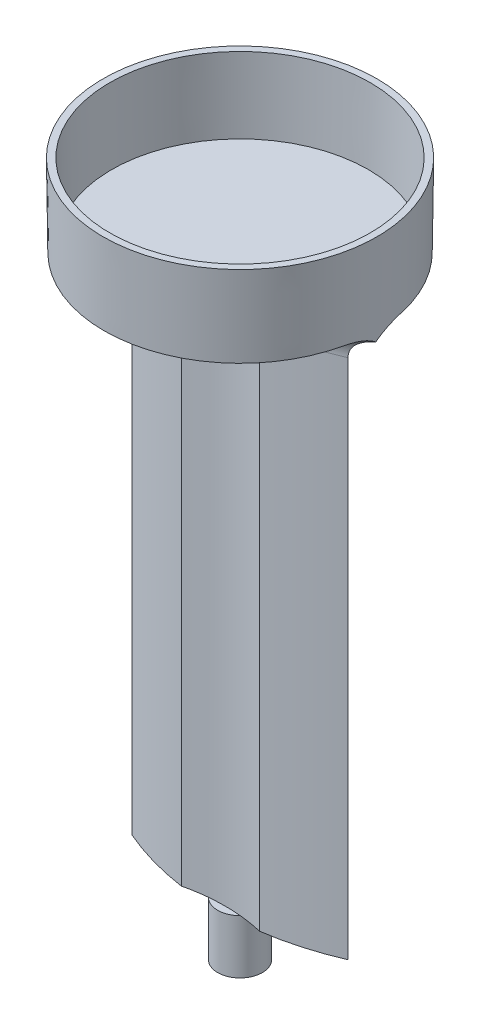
ISO-10303-21;
HEADER;
FILE_DESCRIPTION(('STEP AP214'),'2;1');
FILE_NAME('part.step','',(''),(''),'','','');
FILE_SCHEMA(('AUTOMOTIVE_DESIGN { 1 0 10303 214 1 1 1 1 }'));
ENDSEC;
DATA;
#1=APPLICATION_CONTEXT('core data for automotive mechanical design processes');
#2=APPLICATION_PROTOCOL_DEFINITION('international standard','automotive_design',2000,#1);
#3=PRODUCT_CONTEXT('',#1,'mechanical');
#4=PRODUCT('Part','Part','',(#3));
#5=PRODUCT_RELATED_PRODUCT_CATEGORY('part','',(#4));
#6=PRODUCT_DEFINITION_FORMATION('','',#4);
#7=PRODUCT_DEFINITION_CONTEXT('part definition',#1,'design');
#8=PRODUCT_DEFINITION('design','',#6,#7);
#9=PRODUCT_DEFINITION_SHAPE('','',#8);
#10=(LENGTH_UNIT() NAMED_UNIT(*) SI_UNIT(.MILLI.,.METRE.));
#11=(NAMED_UNIT(*) PLANE_ANGLE_UNIT() SI_UNIT($,.RADIAN.));
#12=(NAMED_UNIT(*) SI_UNIT($,.STERADIAN.) SOLID_ANGLE_UNIT());
#13=UNCERTAINTY_MEASURE_WITH_UNIT(LENGTH_MEASURE(1.E-05),#10,'distance_accuracy_value','');
#14=(GEOMETRIC_REPRESENTATION_CONTEXT(3) GLOBAL_UNCERTAINTY_ASSIGNED_CONTEXT((#13)) GLOBAL_UNIT_ASSIGNED_CONTEXT((#10,
#11,#12)) REPRESENTATION_CONTEXT('',''));
#15=CARTESIAN_POINT('',(0.,0.,0.));
#16=DIRECTION('',(0.,0.,1.));
#17=DIRECTION('',(1.,0.,0.));
#18=AXIS2_PLACEMENT_3D('',#15,#16,#17);
#19=CARTESIAN_POINT('',(0.,-152.,0.));
#20=DIRECTION('',(0.,1.,0.));
#21=DIRECTION('',(0.,0.,1.));
#22=AXIS2_PLACEMENT_3D('',#19,#20,#21);
#23=PLANE('',#22);
#24=CARTESIAN_POINT('',(0.,-152.,0.));
#25=DIRECTION('',(0.,-1.,0.));
#26=DIRECTION('',(0.,0.,-1.));
#27=AXIS2_PLACEMENT_3D('',#24,#25,#26);
#28=CIRCLE('',#27,6.);
#29=CARTESIAN_POINT('',(4.27486119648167,-152.,-4.21017360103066));
#30=VERTEX_POINT('',#29);
#31=CARTESIAN_POINT('',(4.27486119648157,-152.,4.21017360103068));
#32=VERTEX_POINT('',#31);
#33=EDGE_CURVE('E49',#30,#32,#28,.T.);
#34=ORIENTED_EDGE('',*,*,#33,.F.);
#35=CARTESIAN_POINT('',(0.,-152.,-49.0475830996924));
#36=DIRECTION('',(0.,-1.,0.));
#37=DIRECTION('',(0.,0.,1.));
#38=AXIS2_PLACEMENT_3D('',#35,#36,#37);
#39=CIRCLE('',#38,45.0407341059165);
#40=CARTESIAN_POINT('',(10.5,-152.,-5.24783733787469));
#41=VERTEX_POINT('',#40);
#42=EDGE_CURVE('E141',#41,#30,#39,.T.);
#43=ORIENTED_EDGE('',*,*,#42,.F.);
#44=CARTESIAN_POINT('',(0.,-152.,67.));
#45=DIRECTION('',(0.,-1.,0.));
#46=DIRECTION('',(0.,0.,-1.));
#47=AXIS2_PLACEMENT_3D('',#44,#45,#46);
#48=CIRCLE('',#47,73.0068489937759);
#49=CARTESIAN_POINT('',(29.,-152.,0.));
#50=VERTEX_POINT('',#49);
#51=EDGE_CURVE('E179',#41,#50,#48,.T.);
#52=ORIENTED_EDGE('',*,*,#51,.T.);
#53=CARTESIAN_POINT('',(0.,-152.,-67.));
#54=DIRECTION('',(0.,-1.,0.));
#55=DIRECTION('',(0.,0.,1.));
#56=AXIS2_PLACEMENT_3D('',#53,#54,#55);
#57=CIRCLE('',#56,73.0068489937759);
#58=CARTESIAN_POINT('',(10.5,-152.,5.24783733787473));
#59=VERTEX_POINT('',#58);
#60=EDGE_CURVE('E177',#50,#59,#57,.T.);
#61=ORIENTED_EDGE('',*,*,#60,.T.);
#62=CARTESIAN_POINT('',(0.,-152.,49.0475830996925));
#63=DIRECTION('',(0.,-1.,0.));
#64=DIRECTION('',(0.,0.,-1.));
#65=AXIS2_PLACEMENT_3D('',#62,#63,#64);
#66=CIRCLE('',#65,45.0407341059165);
#67=EDGE_CURVE('E61',#32,#59,#66,.T.);
#68=ORIENTED_EDGE('',*,*,#67,.F.);
#69=EDGE_LOOP('',(#34,#43,#52,#61,#68));
#70=FACE_BOUND('',#69,.T.);
#71=ADVANCED_FACE('F33',(#70),#23,.F.);
#72=CARTESIAN_POINT('',(-36.5,-2.,0.));
#73=DIRECTION('',(0.,1.,0.));
#74=DIRECTION('',(0.,0.,1.));
#75=AXIS2_PLACEMENT_3D('',#72,#73,#74);
#76=PLANE('',#75);
#77=CARTESIAN_POINT('',(0.,-2.,0.));
#78=DIRECTION('',(0.,-1.,0.));
#79=DIRECTION('',(0.,0.,-1.));
#80=AXIS2_PLACEMENT_3D('',#77,#78,#79);
#81=CIRCLE('',#80,36.5);
#82=CARTESIAN_POINT('',(35.6177085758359,-2.,7.97676850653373));
#83=VERTEX_POINT('',#82);
#84=CARTESIAN_POINT('',(-35.6177085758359,-2.,7.97676850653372));
#85=VERTEX_POINT('',#84);
#86=EDGE_CURVE('E190',#83,#85,#81,.T.);
#87=ORIENTED_EDGE('',*,*,#86,.T.);
#88=CARTESIAN_POINT('',(0.,-2.,-67.));
#89=DIRECTION('',(0.,1.,0.));
#90=DIRECTION('',(0.,0.,1.));
#91=AXIS2_PLACEMENT_3D('',#88,#89,#90);
#92=CIRCLE('',#91,83.0068489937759);
#93=CARTESIAN_POINT('',(-9.8514383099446,-2.,15.4201804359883));
#94=VERTEX_POINT('',#93);
#95=EDGE_CURVE('E213',#85,#94,#92,.T.);
#96=ORIENTED_EDGE('',*,*,#95,.T.);
#97=CARTESIAN_POINT('',(0.,-2.,49.0475830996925));
#98=DIRECTION('',(0.,1.,0.));
#99=DIRECTION('',(0.,0.,1.));
#100=AXIS2_PLACEMENT_3D('',#97,#98,#99);
#101=CIRCLE('',#100,35.0407341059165);
#102=CARTESIAN_POINT('',(9.85143830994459,-2.,15.4201804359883));
#103=VERTEX_POINT('',#102);
#104=EDGE_CURVE('E211',#94,#103,#101,.F.);
#105=ORIENTED_EDGE('',*,*,#104,.T.);
#106=CARTESIAN_POINT('',(0.,-2.,-67.));
#107=DIRECTION('',(0.,1.,0.));
#108=DIRECTION('',(0.,0.,1.));
#109=AXIS2_PLACEMENT_3D('',#106,#107,#108);
#110=CIRCLE('',#109,83.0068489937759);
#111=EDGE_CURVE('E209',#103,#83,#110,.T.);
#112=ORIENTED_EDGE('',*,*,#111,.T.);
#113=EDGE_LOOP('',(#87,#96,#105,#112));
#114=FACE_BOUND('',#113,.T.);
#115=ADVANCED_FACE('F312',(#114),#76,.F.);
#116=CARTESIAN_POINT('',(0.,-152.,-67.));
#117=DIRECTION('',(0.,1.,0.));
#118=DIRECTION('',(0.,0.,1.));
#119=AXIS2_PLACEMENT_3D('',#116,#117,#118);
#120=CYLINDRICAL_SURFACE('',#119,73.0068489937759);
#121=DIRECTION('',(0.,1.,0.));
#122=VECTOR('',#121,1.);
#123=CARTESIAN_POINT('',(29.,-152.,0.));
#124=LINE('',#123,#122);
#125=CARTESIAN_POINT('',(29.,-12.,0.));
#126=VERTEX_POINT('',#125);
#127=EDGE_CURVE('E181',#50,#126,#124,.T.);
#128=ORIENTED_EDGE('',*,*,#127,.T.);
#129=CARTESIAN_POINT('',(0.,-12.,-67.));
#130=DIRECTION('',(0.,1.,0.));
#131=DIRECTION('',(0.,0.,1.));
#132=AXIS2_PLACEMENT_3D('',#129,#130,#131);
#133=CIRCLE('',#132,73.0068489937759);
#134=CARTESIAN_POINT('',(10.5,-12.,5.24783733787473));
#135=VERTEX_POINT('',#134);
#136=EDGE_CURVE('E218',#126,#135,#133,.F.);
#137=ORIENTED_EDGE('',*,*,#136,.T.);
#138=DIRECTION('',(0.,-1.,0.));
#139=VECTOR('',#138,1.);
#140=CARTESIAN_POINT('',(10.5,-2.,5.24783733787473));
#141=LINE('',#140,#139);
#142=EDGE_CURVE('E168',#135,#59,#141,.T.);
#143=ORIENTED_EDGE('',*,*,#142,.T.);
#144=ORIENTED_EDGE('',*,*,#60,.F.);
#145=EDGE_LOOP('',(#128,#137,#143,#144));
#146=FACE_BOUND('',#145,.T.);
#147=ADVANCED_FACE('F317',(#146),#120,.T.);
#148=CARTESIAN_POINT('',(0.,-152.,67.));
#149=DIRECTION('',(0.,1.,0.));
#150=DIRECTION('',(0.,0.,1.));
#151=AXIS2_PLACEMENT_3D('',#148,#149,#150);
#152=CYLINDRICAL_SURFACE('',#151,73.0068489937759);
#153=DIRECTION('',(0.,1.,0.));
#154=VECTOR('',#153,1.);
#155=CARTESIAN_POINT('',(-29.,-152.,0.));
#156=LINE('',#155,#154);
#157=CARTESIAN_POINT('',(-29.,-152.,0.));
#158=VERTEX_POINT('',#157);
#159=CARTESIAN_POINT('',(-29.,-12.,0.));
#160=VERTEX_POINT('',#159);
#161=EDGE_CURVE('E184',#158,#160,#156,.T.);
#162=ORIENTED_EDGE('',*,*,#161,.T.);
#163=CARTESIAN_POINT('',(0.,-12.,67.));
#164=DIRECTION('',(0.,1.,0.));
#165=DIRECTION('',(0.,0.,1.));
#166=AXIS2_PLACEMENT_3D('',#163,#164,#165);
#167=CIRCLE('',#166,73.0068489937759);
#168=CARTESIAN_POINT('',(-10.5,-12.,-5.24783733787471));
#169=VERTEX_POINT('',#168);
#170=EDGE_CURVE('E222',#160,#169,#167,.F.);
#171=ORIENTED_EDGE('',*,*,#170,.T.);
#172=DIRECTION('',(0.,-1.,0.));
#173=VECTOR('',#172,1.);
#174=CARTESIAN_POINT('',(-10.5,-2.,-5.24783733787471));
#175=LINE('',#174,#173);
#176=CARTESIAN_POINT('',(-10.5,-152.,-5.24783733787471));
#177=VERTEX_POINT('',#176);
#178=EDGE_CURVE('E174',#169,#177,#175,.T.);
#179=ORIENTED_EDGE('',*,*,#178,.T.);
#180=EDGE_CURVE('E152',#158,#177,#48,.T.);
#181=ORIENTED_EDGE('',*,*,#180,.F.);
#182=EDGE_LOOP('',(#162,#171,#179,#181));
#183=FACE_BOUND('',#182,.T.);
#184=ADVANCED_FACE('F330',(#183),#152,.T.);
#185=CARTESIAN_POINT('',(-34.49,0.,0.));
#186=DIRECTION('',(0.,-1.,0.));
#187=DIRECTION('',(0.,0.,-1.));
#188=AXIS2_PLACEMENT_3D('',#185,#186,#187);
#189=PLANE('',#188);
#190=CARTESIAN_POINT('',(0.,0.,0.));
#191=DIRECTION('',(0.,-1.,0.));
#192=DIRECTION('',(0.,0.,-1.));
#193=AXIS2_PLACEMENT_3D('',#190,#191,#192);
#194=CIRCLE('',#193,34.49);
#195=CARTESIAN_POINT('',(0.,0.,-34.49));
#196=VERTEX_POINT('',#195);
#197=EDGE_CURVE('E197',#196,#196,#194,.T.);
#198=ORIENTED_EDGE('',*,*,#197,.F.);
#199=EDGE_LOOP('',(#198));
#200=FACE_BOUND('',#199,.T.);
#201=ADVANCED_FACE('F252',(#200),#189,.F.);
#202=CARTESIAN_POINT('',(0.,0.,0.));
#203=DIRECTION('',(0.,1.,0.));
#204=DIRECTION('',(0.,0.,1.));
#205=AXIS2_PLACEMENT_3D('',#202,#203,#204);
#206=CONICAL_SURFACE('',#205,34.49,0.0239953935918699);
#207=CARTESIAN_POINT('',(0.,20.,0.));
#208=DIRECTION('',(0.,-1.,0.));
#209=DIRECTION('',(0.,0.,-1.));
#210=AXIS2_PLACEMENT_3D('',#207,#208,#209);
#211=CIRCLE('',#210,34.97);
#212=CARTESIAN_POINT('',(0.,20.,-34.97));
#213=VERTEX_POINT('',#212);
#214=EDGE_CURVE('E194',#213,#213,#211,.T.);
#215=ORIENTED_EDGE('',*,*,#214,.F.);
#216=EDGE_LOOP('',(#215));
#217=FACE_BOUND('',#216,.T.);
#218=ORIENTED_EDGE('',*,*,#197,.T.);
#219=EDGE_LOOP('',(#218));
#220=FACE_BOUND('',#219,.T.);
#221=ADVANCED_FACE('F343',(#217,#220),#206,.F.);
#222=CARTESIAN_POINT('',(-34.97,20.,0.));
#223=DIRECTION('',(0.,-1.,0.));
#224=DIRECTION('',(0.,0.,-1.));
#225=AXIS2_PLACEMENT_3D('',#222,#223,#224);
#226=PLANE('',#225);
#227=CARTESIAN_POINT('',(0.,20.,0.));
#228=DIRECTION('',(0.,-1.,0.));
#229=DIRECTION('',(0.,0.,-1.));
#230=AXIS2_PLACEMENT_3D('',#227,#228,#229);
#231=CIRCLE('',#230,36.77);
#232=CARTESIAN_POINT('',(0.,20.,-36.77));
#233=VERTEX_POINT('',#232);
#234=EDGE_CURVE('E191',#233,#233,#231,.T.);
#235=ORIENTED_EDGE('',*,*,#234,.F.);
#236=EDGE_LOOP('',(#235));
#237=FACE_BOUND('',#236,.T.);
#238=ORIENTED_EDGE('',*,*,#214,.T.);
#239=EDGE_LOOP('',(#238));
#240=FACE_BOUND('',#239,.T.);
#241=ADVANCED_FACE('F494',(#237,#240),#226,.F.);
#242=CARTESIAN_POINT('',(0.,20.,0.));
#243=DIRECTION('',(0.,1.,0.));
#244=DIRECTION('',(0.,0.,1.));
#245=AXIS2_PLACEMENT_3D('',#242,#243,#244);
#246=CONICAL_SURFACE('',#245,36.77,0.0122721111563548);
#247=CARTESIAN_POINT('',(35.6177085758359,-2.,7.97676850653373));
#248=CARTESIAN_POINT('',(35.6651768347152,-2.00000463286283,7.76482371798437));
#249=CARTESIAN_POINT('',(35.7106902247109,-2.00439085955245,7.55246683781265));
#250=CARTESIAN_POINT('',(35.7977520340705,-2.02222681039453,7.12728083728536));
#251=CARTESIAN_POINT('',(35.8392996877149,-2.03567828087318,6.91445163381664));
#252=CARTESIAN_POINT('',(35.9580011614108,-2.09013211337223,6.27528013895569));
#253=CARTESIAN_POINT('',(36.0290733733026,-2.14523568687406,5.84888015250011));
#254=CARTESIAN_POINT('',(36.152370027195,-2.29251086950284,5.01643792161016));
#255=CARTESIAN_POINT('',(36.2051956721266,-2.38323209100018,4.61022711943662));
#256=CARTESIAN_POINT('',(36.2957226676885,-2.6034447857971,3.8069601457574));
#257=CARTESIAN_POINT('',(36.3334379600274,-2.73290032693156,3.40989585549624));
#258=CARTESIAN_POINT('',(36.3849240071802,-2.98495377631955,2.75266126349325));
#259=CARTESIAN_POINT('',(36.4024948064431,-3.09693044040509,2.48867143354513));
#260=CARTESIAN_POINT('',(36.4312925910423,-3.34001780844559,1.96932583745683));
#261=CARTESIAN_POINT('',(36.4425210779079,-3.47112397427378,1.71396804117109));
#262=CARTESIAN_POINT('',(36.45936265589,-3.75622928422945,1.2073542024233));
#263=CARTESIAN_POINT('',(36.4648222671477,-3.91073473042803,0.956377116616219));
#264=CARTESIAN_POINT('',(36.4703382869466,-4.23986246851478,0.467643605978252));
#265=CARTESIAN_POINT('',(36.4703904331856,-4.41450052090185,0.229897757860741));
#266=CARTESIAN_POINT('',(36.4681029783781,-4.59901657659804,0.));
#267=B_SPLINE_CURVE_WITH_KNOTS('',3,(#247,#248,#249,#250,#251,#252,#253,#254,#255,#256,#257,
#258,#259,#260,#261,#262,#263,#264,#265,#266),.UNSPECIFIED.,.F.,.F.,(4,2,2,2,2,2,2,2,2,4),(0.,
0.651475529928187,1.3030765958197,2.6081963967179,3.86491786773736,5.12047712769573,
5.98160963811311,6.8425381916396,7.72583548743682,8.60982901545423),.UNSPECIFIED.);
#268=CARTESIAN_POINT('',(36.4681029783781,-4.59901657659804,0.));
#269=VERTEX_POINT('',#268);
#270=EDGE_CURVE('E234',#83,#269,#267,.T.);
#271=ORIENTED_EDGE('',*,*,#270,.T.);
#272=CARTESIAN_POINT('',(36.4681029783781,-4.59901657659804,0.));
#273=CARTESIAN_POINT('',(36.4705817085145,-4.39964865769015,-0.248385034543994));
#274=CARTESIAN_POINT('',(36.4703193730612,-4.21183234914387,-0.505928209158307));
#275=CARTESIAN_POINT('',(36.4634082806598,-3.85974136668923,-1.03626142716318));
#276=CARTESIAN_POINT('',(36.4567648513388,-3.69544718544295,-1.30903857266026));
#277=CARTESIAN_POINT('',(36.4362472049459,-3.39128754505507,-1.86576242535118));
#278=CARTESIAN_POINT('',(36.4224102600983,-3.2513010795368,-2.14964464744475));
#279=CARTESIAN_POINT('',(36.3868773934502,-2.99453007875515,-2.72726728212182));
#280=CARTESIAN_POINT('',(36.365180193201,-2.87774932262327,-3.02100929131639));
#281=CARTESIAN_POINT('',(36.313547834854,-2.66733451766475,-3.61482850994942));
#282=CARTESIAN_POINT('',(36.2836402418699,-2.57362497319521,-3.91488147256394));
#283=CARTESIAN_POINT('',(36.215278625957,-2.40820137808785,-4.52002539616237));
#284=CARTESIAN_POINT('',(36.176824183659,-2.33648840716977,-4.82511660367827));
#285=CARTESIAN_POINT('',(36.0912439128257,-2.21426151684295,-5.43838843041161));
#286=CARTESIAN_POINT('',(36.044115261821,-2.16375451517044,-5.74657002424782));
#287=CARTESIAN_POINT('',(35.9412328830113,-2.08312094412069,-6.36405777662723));
#288=CARTESIAN_POINT('',(35.885481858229,-2.05298800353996,-6.67336355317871));
#289=CARTESIAN_POINT('',(35.7932536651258,-2.02162445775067,-7.14858713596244));
#290=CARTESIAN_POINT('',(35.7597852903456,-2.01347222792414,-7.31467066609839));
#291=CARTESIAN_POINT('',(35.6905059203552,-2.00266622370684,-7.64617719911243));
#292=CARTESIAN_POINT('',(35.654699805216,-2.00000135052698,-7.81160085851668));
#293=CARTESIAN_POINT('',(35.6177085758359,-2.00000000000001,-7.97676850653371));
#294=B_SPLINE_CURVE_WITH_KNOTS('',3,(#272,#273,#274,#275,#276,#277,#278,#279,#280,#281,#282,
#283,#284,#285,#286,#287,#288,#289,#290,#291,#292,#293),.UNSPECIFIED.,.F.,.F.,(4,2,2,2,2,2,2,2,
2,2,4),(0.,0.955023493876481,1.90925032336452,2.85858151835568,3.8080671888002,4.75440329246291,
5.70078584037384,6.64747687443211,7.59387173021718,8.10263342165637,8.61036507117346),.UNSPECIFIED.);
#295=CARTESIAN_POINT('',(35.6177085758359,-2.,-7.97676850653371));
#296=VERTEX_POINT('',#295);
#297=EDGE_CURVE('E373',#269,#296,#294,.T.);
#298=ORIENTED_EDGE('',*,*,#297,.T.);
#299=CARTESIAN_POINT('',(-35.6177085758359,-2.,-7.97676850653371));
#300=VERTEX_POINT('',#299);
#301=EDGE_CURVE('E187',#300,#296,#81,.T.);
#302=ORIENTED_EDGE('',*,*,#301,.F.);
#303=CARTESIAN_POINT('',(-35.6177085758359,-2.,-7.97676850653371));
#304=CARTESIAN_POINT('',(-35.6651768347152,-2.00000463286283,-7.76482371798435));
#305=CARTESIAN_POINT('',(-35.7106902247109,-2.00439085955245,-7.55246683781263));
#306=CARTESIAN_POINT('',(-35.7977520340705,-2.02222681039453,-7.12728083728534));
#307=CARTESIAN_POINT('',(-35.8392996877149,-2.03567828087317,-6.91445163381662));
#308=CARTESIAN_POINT('',(-35.9580011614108,-2.09013211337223,-6.27528013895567));
#309=CARTESIAN_POINT('',(-36.0290733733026,-2.14523568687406,-5.84888015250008));
#310=CARTESIAN_POINT('',(-36.152370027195,-2.29251086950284,-5.01643792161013));
#311=CARTESIAN_POINT('',(-36.2051956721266,-2.38323209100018,-4.6102271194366));
#312=CARTESIAN_POINT('',(-36.2957226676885,-2.6034447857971,-3.80696014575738));
#313=CARTESIAN_POINT('',(-36.3334379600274,-2.73290032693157,-3.40989585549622));
#314=CARTESIAN_POINT('',(-36.3849240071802,-2.98495377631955,-2.75266126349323));
#315=CARTESIAN_POINT('',(-36.4024948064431,-3.09693044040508,-2.4886714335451));
#316=CARTESIAN_POINT('',(-36.4312925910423,-3.34001780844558,-1.9693258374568));
#317=CARTESIAN_POINT('',(-36.4425210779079,-3.47112397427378,-1.71396804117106));
#318=CARTESIAN_POINT('',(-36.45936265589,-3.75622928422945,-1.20735420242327));
#319=CARTESIAN_POINT('',(-36.4648222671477,-3.91073473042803,-0.95637711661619));
#320=CARTESIAN_POINT('',(-36.4703382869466,-4.2398624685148,-0.467643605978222));
#321=CARTESIAN_POINT('',(-36.4703904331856,-4.41450052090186,-0.229897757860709));
#322=CARTESIAN_POINT('',(-36.4681029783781,-4.59901657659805,0.));
#323=B_SPLINE_CURVE_WITH_KNOTS('',3,(#303,#304,#305,#306,#307,#308,#309,#310,#311,#312,#313,
#314,#315,#316,#317,#318,#319,#320,#321,#322),.UNSPECIFIED.,.F.,.F.,(4,2,2,2,2,2,2,2,2,4),(0.,
0.651475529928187,1.3030765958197,2.6081963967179,3.86491786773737,5.12047712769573,
5.98160963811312,6.8425381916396,7.72583548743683,8.60982901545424),.UNSPECIFIED.);
#324=CARTESIAN_POINT('',(-36.468102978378,-4.59901657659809,0.));
#325=VERTEX_POINT('',#324);
#326=EDGE_CURVE('E47',#300,#325,#323,.T.);
#327=ORIENTED_EDGE('',*,*,#326,.T.);
#328=CARTESIAN_POINT('',(-36.468102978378,-4.59901657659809,0.));
#329=CARTESIAN_POINT('',(-36.4705817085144,-4.39964865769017,0.248385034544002));
#330=CARTESIAN_POINT('',(-36.4703193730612,-4.21183234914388,0.505928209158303));
#331=CARTESIAN_POINT('',(-36.4634082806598,-3.85974136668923,1.03626142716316));
#332=CARTESIAN_POINT('',(-36.4567648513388,-3.69544718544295,1.30903857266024));
#333=CARTESIAN_POINT('',(-36.4362472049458,-3.39128754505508,1.86576242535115));
#334=CARTESIAN_POINT('',(-36.4224102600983,-3.25130107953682,2.14964464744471));
#335=CARTESIAN_POINT('',(-36.3868773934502,-2.99453007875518,2.72726728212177));
#336=CARTESIAN_POINT('',(-36.365180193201,-2.8777493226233,3.02100929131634));
#337=CARTESIAN_POINT('',(-36.313547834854,-2.66733451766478,3.61482850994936));
#338=CARTESIAN_POINT('',(-36.2836402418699,-2.57362497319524,3.91488147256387));
#339=CARTESIAN_POINT('',(-36.2152786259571,-2.40820137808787,4.52002539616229));
#340=CARTESIAN_POINT('',(-36.176824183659,-2.33648840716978,4.82511660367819));
#341=CARTESIAN_POINT('',(-36.0912439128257,-2.21426151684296,5.43838843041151));
#342=CARTESIAN_POINT('',(-36.044115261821,-2.16375451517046,5.74657002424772));
#343=CARTESIAN_POINT('',(-35.9412328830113,-2.08312094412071,6.36405777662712));
#344=CARTESIAN_POINT('',(-35.885481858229,-2.05298800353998,6.6733635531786));
#345=CARTESIAN_POINT('',(-35.7932536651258,-2.02162445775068,7.14858713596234));
#346=CARTESIAN_POINT('',(-35.7597852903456,-2.01347222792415,7.31467066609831));
#347=CARTESIAN_POINT('',(-35.6905059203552,-2.00266622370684,7.64617719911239));
#348=CARTESIAN_POINT('',(-35.654699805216,-2.00000135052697,7.81160085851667));
#349=CARTESIAN_POINT('',(-35.6177085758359,-2.00000000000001,7.97676850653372));
#350=B_SPLINE_CURVE_WITH_KNOTS('',3,(#328,#329,#330,#331,#332,#333,#334,#335,#336,#337,#338,
#339,#340,#341,#342,#343,#344,#345,#346,#347,#348,#349),.UNSPECIFIED.,.F.,.F.,(4,2,2,2,2,2,2,2,
2,2,4),(0.,0.955023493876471,1.9092503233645,2.85858151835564,3.80806718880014,4.75440329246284,
5.70078584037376,6.647476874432,7.59387173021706,8.10263342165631,8.61036507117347),.UNSPECIFIED.);
#351=EDGE_CURVE('E226',#325,#85,#350,.T.);
#352=ORIENTED_EDGE('',*,*,#351,.T.);
#353=ORIENTED_EDGE('',*,*,#86,.F.);
#354=EDGE_LOOP('',(#271,#298,#302,#327,#352,#353));
#355=FACE_BOUND('',#354,.T.);
#356=ORIENTED_EDGE('',*,*,#234,.T.);
#357=EDGE_LOOP('',(#356));
#358=FACE_BOUND('',#357,.T.);
#359=ADVANCED_FACE('F240',(#355,#358),#246,.T.);
#360=ORIENTED_EDGE('',*,*,#301,.T.);
#361=CARTESIAN_POINT('',(0.,-2.,67.));
#362=DIRECTION('',(0.,1.,0.));
#363=DIRECTION('',(0.,0.,1.));
#364=AXIS2_PLACEMENT_3D('',#361,#362,#363);
#365=CIRCLE('',#364,83.0068489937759);
#366=CARTESIAN_POINT('',(9.85143830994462,-2.,-15.4201804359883));
#367=VERTEX_POINT('',#366);
#368=EDGE_CURVE('E207',#296,#367,#365,.T.);
#369=ORIENTED_EDGE('',*,*,#368,.T.);
#370=CARTESIAN_POINT('',(0.,-2.,-49.0475830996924));
#371=DIRECTION('',(0.,1.,0.));
#372=DIRECTION('',(0.,0.,1.));
#373=AXIS2_PLACEMENT_3D('',#370,#371,#372);
#374=CIRCLE('',#373,35.0407341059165);
#375=CARTESIAN_POINT('',(-9.85143830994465,-2.,-15.4201804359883));
#376=VERTEX_POINT('',#375);
#377=EDGE_CURVE('E203',#367,#376,#374,.F.);
#378=ORIENTED_EDGE('',*,*,#377,.T.);
#379=CARTESIAN_POINT('',(0.,-2.,67.));
#380=DIRECTION('',(0.,1.,0.));
#381=DIRECTION('',(0.,0.,1.));
#382=AXIS2_PLACEMENT_3D('',#379,#380,#381);
#383=CIRCLE('',#382,83.0068489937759);
#384=EDGE_CURVE('E205',#376,#300,#383,.T.);
#385=ORIENTED_EDGE('',*,*,#384,.T.);
#386=EDGE_LOOP('',(#360,#369,#378,#385));
#387=FACE_BOUND('',#386,.T.);
#388=ADVANCED_FACE('F319',(#387),#76,.F.);
#389=DIRECTION('',(0.,-1.,0.));
#390=VECTOR('',#389,1.);
#391=CARTESIAN_POINT('',(-10.5,-2.,5.24783733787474));
#392=LINE('',#391,#390);
#393=CARTESIAN_POINT('',(-10.5,-12.,5.24783733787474));
#394=VERTEX_POINT('',#393);
#395=CARTESIAN_POINT('',(-10.4999999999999,-152.,5.24783733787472));
#396=VERTEX_POINT('',#395);
#397=EDGE_CURVE('E166',#394,#396,#392,.T.);
#398=ORIENTED_EDGE('',*,*,#397,.F.);
#399=CARTESIAN_POINT('',(0.,-12.,-67.));
#400=DIRECTION('',(0.,1.,0.));
#401=DIRECTION('',(0.,0.,1.));
#402=AXIS2_PLACEMENT_3D('',#399,#400,#401);
#403=CIRCLE('',#402,73.0068489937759);
#404=EDGE_CURVE('E200',#394,#160,#403,.F.);
#405=ORIENTED_EDGE('',*,*,#404,.T.);
#406=ORIENTED_EDGE('',*,*,#161,.F.);
#407=EDGE_CURVE('E171',#396,#158,#57,.T.);
#408=ORIENTED_EDGE('',*,*,#407,.F.);
#409=EDGE_LOOP('',(#398,#405,#406,#408));
#410=FACE_BOUND('',#409,.T.);
#411=ADVANCED_FACE('F328',(#410),#120,.T.);
#412=DIRECTION('',(0.,-1.,0.));
#413=VECTOR('',#412,1.);
#414=CARTESIAN_POINT('',(10.5,-2.,-5.24783733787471));
#415=LINE('',#414,#413);
#416=CARTESIAN_POINT('',(10.5,-12.,-5.24783733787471));
#417=VERTEX_POINT('',#416);
#418=EDGE_CURVE('E173',#417,#41,#415,.T.);
#419=ORIENTED_EDGE('',*,*,#418,.F.);
#420=CARTESIAN_POINT('',(0.,-12.,67.));
#421=DIRECTION('',(0.,1.,0.));
#422=DIRECTION('',(0.,0.,1.));
#423=AXIS2_PLACEMENT_3D('',#420,#421,#422);
#424=CIRCLE('',#423,73.0068489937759);
#425=EDGE_CURVE('E220',#417,#126,#424,.F.);
#426=ORIENTED_EDGE('',*,*,#425,.T.);
#427=ORIENTED_EDGE('',*,*,#127,.F.);
#428=ORIENTED_EDGE('',*,*,#51,.F.);
#429=EDGE_LOOP('',(#419,#426,#427,#428));
#430=FACE_BOUND('',#429,.T.);
#431=ADVANCED_FACE('F323',(#430),#152,.T.);
#432=CARTESIAN_POINT('',(-4.27486119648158,-152.,4.21017360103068));
#433=VERTEX_POINT('',#432);
#434=CARTESIAN_POINT('',(-4.27486119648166,-152.,-4.21017360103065));
#435=VERTEX_POINT('',#434);
#436=EDGE_CURVE('E11',#433,#435,#28,.T.);
#437=ORIENTED_EDGE('',*,*,#436,.F.);
#438=EDGE_CURVE('E164',#396,#433,#66,.T.);
#439=ORIENTED_EDGE('',*,*,#438,.F.);
#440=ORIENTED_EDGE('',*,*,#407,.T.);
#441=ORIENTED_EDGE('',*,*,#180,.T.);
#442=EDGE_CURVE('E139',#435,#177,#39,.T.);
#443=ORIENTED_EDGE('',*,*,#442,.F.);
#444=EDGE_LOOP('',(#437,#439,#440,#441,#443));
#445=FACE_BOUND('',#444,.T.);
#446=ADVANCED_FACE('F148',(#445),#23,.F.);
#447=CARTESIAN_POINT('',(0.,-2.,-49.0475830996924));
#448=DIRECTION('',(0.,-1.,0.));
#449=DIRECTION('',(0.,0.,-1.));
#450=AXIS2_PLACEMENT_3D('',#447,#448,#449);
#451=CYLINDRICAL_SURFACE('',#450,45.0407341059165);
#452=ORIENTED_EDGE('',*,*,#178,.F.);
#453=CARTESIAN_POINT('',(0.,-12.,-49.0475830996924));
#454=DIRECTION('',(0.,1.,0.));
#455=DIRECTION('',(0.,0.,1.));
#456=AXIS2_PLACEMENT_3D('',#453,#454,#455);
#457=CIRCLE('',#456,45.0407341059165);
#458=EDGE_CURVE('E224',#169,#417,#457,.T.);
#459=ORIENTED_EDGE('',*,*,#458,.T.);
#460=ORIENTED_EDGE('',*,*,#418,.T.);
#461=ORIENTED_EDGE('',*,*,#42,.T.);
#462=EDGE_CURVE('E135',#30,#435,#39,.T.);
#463=ORIENTED_EDGE('',*,*,#462,.T.);
#464=ORIENTED_EDGE('',*,*,#442,.T.);
#465=EDGE_LOOP('',(#452,#459,#460,#461,#463,#464));
#466=FACE_BOUND('',#465,.T.);
#467=ADVANCED_FACE('F138',(#466),#451,.F.);
#468=CARTESIAN_POINT('',(0.,-2.,49.0475830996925));
#469=DIRECTION('',(0.,-1.,0.));
#470=DIRECTION('',(0.,0.,-1.));
#471=AXIS2_PLACEMENT_3D('',#468,#469,#470);
#472=CYLINDRICAL_SURFACE('',#471,45.0407341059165);
#473=ORIENTED_EDGE('',*,*,#142,.F.);
#474=CARTESIAN_POINT('',(0.,-12.,49.0475830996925));
#475=DIRECTION('',(0.,1.,0.));
#476=DIRECTION('',(0.,0.,1.));
#477=AXIS2_PLACEMENT_3D('',#474,#475,#476);
#478=CIRCLE('',#477,45.0407341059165);
#479=EDGE_CURVE('E216',#135,#394,#478,.T.);
#480=ORIENTED_EDGE('',*,*,#479,.T.);
#481=ORIENTED_EDGE('',*,*,#397,.T.);
#482=ORIENTED_EDGE('',*,*,#438,.T.);
#483=EDGE_CURVE('E167',#433,#32,#66,.T.);
#484=ORIENTED_EDGE('',*,*,#483,.T.);
#485=ORIENTED_EDGE('',*,*,#67,.T.);
#486=EDGE_LOOP('',(#473,#480,#481,#482,#484,#485));
#487=FACE_BOUND('',#486,.T.);
#488=ADVANCED_FACE('F308',(#487),#472,.F.);
#489=CARTESIAN_POINT('',(0.,-12.,67.));
#490=DIRECTION('',(0.,1.,0.));
#491=DIRECTION('',(0.,0.,1.));
#492=AXIS2_PLACEMENT_3D('',#489,#490,#491);
#493=TOROIDAL_SURFACE('',#492,83.0068489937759,10.);
#494=ORIENTED_EDGE('',*,*,#368,.F.);
#495=ORIENTED_EDGE('',*,*,#297,.F.);
#496=CARTESIAN_POINT('',(49.0013977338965,-22.,0.));
#497=CARTESIAN_POINT('',(48.9945686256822,-21.9999999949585,0.));
#498=CARTESIAN_POINT('',(48.9877394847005,-21.9999975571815,0.));
#499=CARTESIAN_POINT('',(48.1345741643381,-21.9993892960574,9.14421740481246E-13));
#500=CARTESIAN_POINT('',(47.2877657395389,-21.9614484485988,1.92573242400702E-13));
#501=CARTESIAN_POINT('',(46.0221031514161,-21.8532828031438,0.));
#502=CARTESIAN_POINT('',(45.600725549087,-21.8086435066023,0.));
#503=CARTESIAN_POINT('',(44.7600289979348,-21.7028030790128,0.));
#504=CARTESIAN_POINT('',(44.3407099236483,-21.6416029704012,0.));
#505=CARTESIAN_POINT('',(43.5038971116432,-21.5029400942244,0.));
#506=CARTESIAN_POINT('',(43.0864089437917,-21.4254439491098,0.));
#507=CARTESIAN_POINT('',(42.2547009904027,-21.2545416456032,0.));
#508=CARTESIAN_POINT('',(41.8404811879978,-21.1611355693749,0.));
#509=CARTESIAN_POINT('',(41.0161576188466,-20.9585750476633,0.));
#510=CARTESIAN_POINT('',(40.6060516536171,-20.8494295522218,0.));
#511=CARTESIAN_POINT('',(39.7904344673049,-20.6152657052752,0.));
#512=CARTESIAN_POINT('',(39.3849228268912,-20.4902488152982,0.));
#513=CARTESIAN_POINT('',(38.5424197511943,-20.2118335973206,0.));
#514=CARTESIAN_POINT('',(38.1059384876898,-20.0568856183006,0.));
#515=CARTESIAN_POINT('',(37.2406311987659,-19.7268451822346,0.));
#516=CARTESIAN_POINT('',(36.811805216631,-19.5517526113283,0.));
#517=CARTESIAN_POINT('',(35.9637838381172,-19.1801361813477,0.));
#518=CARTESIAN_POINT('',(35.5445833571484,-18.9836239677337,0.));
#519=CARTESIAN_POINT('',(34.7180980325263,-18.5669973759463,0.));
#520=CARTESIAN_POINT('',(34.3108101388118,-18.3468891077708,0.));
#521=CARTESIAN_POINT('',(33.6345733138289,-17.9515583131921,0.));
#522=CARTESIAN_POINT('',(33.3615488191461,-17.7833073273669,0.));
#523=CARTESIAN_POINT('',(32.8247926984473,-17.4323609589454,0.));
#524=CARTESIAN_POINT('',(32.5610631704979,-17.2496623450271,0.));
#525=CARTESIAN_POINT('',(32.046154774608,-16.8683549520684,0.));
#526=CARTESIAN_POINT('',(31.7949501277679,-16.6697812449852,0.));
#527=CARTESIAN_POINT('',(31.3085090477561,-16.2541083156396,0.));
#528=CARTESIAN_POINT('',(31.0732609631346,-16.0370228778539,0.));
#529=CARTESIAN_POINT('',(30.6255420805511,-15.5825134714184,0.));
#530=CARTESIAN_POINT('',(30.4129560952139,-15.3452045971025,0.));
#531=CARTESIAN_POINT('',(30.0178837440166,-14.846340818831,0.));
#532=CARTESIAN_POINT('',(29.835387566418,-14.584793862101,0.));
#533=CARTESIAN_POINT('',(29.5385529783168,-14.0784177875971,0.));
#534=CARTESIAN_POINT('',(29.4180279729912,-13.8373182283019,0.));
#535=CARTESIAN_POINT('',(29.2680910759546,-13.4636671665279,0.));
#536=CARTESIAN_POINT('',(29.2232795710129,-13.3372320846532,0.));
#537=CARTESIAN_POINT('',(29.1451049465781,-13.0808962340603,0.));
#538=CARTESIAN_POINT('',(29.1117359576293,-12.9509972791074,0.));
#539=CARTESIAN_POINT('',(29.0568016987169,-12.685057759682,0.));
#540=CARTESIAN_POINT('',(29.035578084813,-12.5489459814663,0.));
#541=CARTESIAN_POINT('',(29.0071766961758,-12.275219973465,0.));
#542=CARTESIAN_POINT('',(29.000001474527,-12.1376054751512,0.));
#543=CARTESIAN_POINT('',(28.9999986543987,-11.8744261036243,0.));
#544=CARTESIAN_POINT('',(29.0059714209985,-11.7488597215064,0.));
#545=CARTESIAN_POINT('',(29.0296554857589,-11.4987978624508,0.));
#546=CARTESIAN_POINT('',(29.0473711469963,-11.3743028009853,0.));
#547=CARTESIAN_POINT('',(29.0939972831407,-11.1272524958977,0.));
#548=CARTESIAN_POINT('',(29.1229243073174,-11.0047003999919,0.));
#549=CARTESIAN_POINT('',(29.1911205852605,-10.7624607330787,0.));
#550=CARTESIAN_POINT('',(29.2303957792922,-10.6427748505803,0.));
#551=CARTESIAN_POINT('',(29.3304137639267,-10.3742866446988,0.));
#552=CARTESIAN_POINT('',(29.3940897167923,-10.2265764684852,0.));
#553=CARTESIAN_POINT('',(29.5344617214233,-9.9374082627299,0.));
#554=CARTESIAN_POINT('',(29.6111683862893,-9.7959554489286,0.));
#555=CARTESIAN_POINT('',(29.7756281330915,-9.51937266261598,0.));
#556=CARTESIAN_POINT('',(29.8633980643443,-9.38425277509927,0.));
#557=CARTESIAN_POINT('',(30.0480588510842,-9.1204987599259,0.));
#558=CARTESIAN_POINT('',(30.1449476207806,-8.99186315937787,0.));
#559=CARTESIAN_POINT('',(30.422464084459,-8.64582600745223,0.));
#560=CARTESIAN_POINT('',(30.6110492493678,-8.43479301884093,0.));
#561=CARTESIAN_POINT('',(31.0055582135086,-8.0295933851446,0.));
#562=CARTESIAN_POINT('',(31.2114959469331,-7.83544055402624,0.));
#563=CARTESIAN_POINT('',(31.6369342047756,-7.46163130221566,0.));
#564=CARTESIAN_POINT('',(31.8564664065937,-7.28201117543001,0.));
#565=CARTESIAN_POINT('',(32.3056215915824,-6.93609030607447,0.));
#566=CARTESIAN_POINT('',(32.5352421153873,-6.76978634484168,0.));
#567=CARTESIAN_POINT('',(33.054719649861,-6.41317182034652,0.));
#568=CARTESIAN_POINT('',(33.3465812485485,-6.22578903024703,0.));
#569=CARTESIAN_POINT('',(33.9397722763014,-5.86658216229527,0.));
#570=CARTESIAN_POINT('',(34.2411043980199,-5.69476256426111,0.));
#571=CARTESIAN_POINT('',(34.8517068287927,-5.3649887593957,0.));
#572=CARTESIAN_POINT('',(35.1609863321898,-5.20705164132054,0.));
#573=CARTESIAN_POINT('',(35.7858068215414,-4.90411884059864,0.));
#574=CARTESIAN_POINT('',(36.1013479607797,-4.75912347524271,0.));
#575=CARTESIAN_POINT('',(36.7384942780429,-4.48088024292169,0.));
#576=CARTESIAN_POINT('',(37.0601126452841,-4.34766265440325,0.));
#577=CARTESIAN_POINT('',(37.7079137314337,-4.09275185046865,0.));
#578=CARTESIAN_POINT('',(38.0340969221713,-3.9710598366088,0.));
#579=CARTESIAN_POINT('',(38.6904302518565,-3.73877147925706,0.));
#580=CARTESIAN_POINT('',(39.0205808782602,-3.62817651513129,0.));
#581=CARTESIAN_POINT('',(39.6843167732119,-3.41781959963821,0.));
#582=CARTESIAN_POINT('',(40.0179020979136,-3.31805782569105,0.));
#583=CARTESIAN_POINT('',(40.704238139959,-3.12466176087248,0.));
#584=CARTESIAN_POINT('',(41.0571374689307,-3.03155478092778,0.));
#585=CARTESIAN_POINT('',(41.765727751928,-2.85704304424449,0.));
#586=CARTESIAN_POINT('',(42.1214180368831,-2.77563556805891,0.));
#587=CARTESIAN_POINT('',(42.8354373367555,-2.62451893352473,0.));
#588=CARTESIAN_POINT('',(43.1937674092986,-2.55481476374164,0.));
#589=CARTESIAN_POINT('',(43.9125452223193,-2.42730303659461,0.));
#590=CARTESIAN_POINT('',(44.2729930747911,-2.3694961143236,0.));
#591=CARTESIAN_POINT('',(45.3541141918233,-2.21466874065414,0.));
#592=CARTESIAN_POINT('',(46.0774430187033,-2.13563083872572,-6.15785345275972E-13));
#593=CARTESIAN_POINT('',(47.527555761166,-2.02857626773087,6.46724847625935E-13));
#594=CARTESIAN_POINT('',(48.2543370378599,-2.00052545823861,2.42526294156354E-12));
#595=CARTESIAN_POINT('',(48.9877394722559,-2.00000244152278,0.));
#596=CARTESIAN_POINT('',(48.9945686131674,-2.00000000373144,0.));
#597=CARTESIAN_POINT('',(49.0013977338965,-2.00000000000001,0.));
#598=B_SPLINE_CURVE_WITH_KNOTS('',3,(#496,#497,#498,#499,#500,#501,#502,#503,#504,#505,#506,
#507,#508,#509,#510,#511,#512,#513,#514,#515,#516,#517,#518,#519,#520,#521,#522,#523,#524,#525,
#526,#527,#528,#529,#530,#531,#532,#533,#534,#535,#536,#537,#538,#539,#540,#541,#542,#543,#544,
#545,#546,#547,#548,#549,#550,#551,#552,#553,#554,#555,#556,#557,#558,#559,#560,#561,#562,#563,
#564,#565,#566,#567,#568,#569,#570,#571,#572,#573,#574,#575,#576,#577,#578,#579,#580,#581,#582,
#583,#584,#585,#586,#587,#588,#589,#590,#591,#592,#593,#594,#595,#596,#597),.UNSPECIFIED.,.F.,
.F.,(4,2,2,2,2,2,2,2,2,2,2,2,2,2,2,2,2,2,2,2,2,2,2,2,2,2,2,2,2,2,2,2,2,2,2,2,2,2,2,2,2,2,2,2,2,
2,2,2,2,2,4),(0.,0.0204874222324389,2.55948434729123,3.83049045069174,5.10141810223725,
6.37497467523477,7.64852467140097,8.92135331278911,10.1940648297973,11.5830961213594,
12.9721352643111,14.3604229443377,15.7483520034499,16.7100872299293,17.6720381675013,
18.6319197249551,19.5910926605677,20.5451310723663,21.4988577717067,22.3042075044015,
22.7061813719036,23.1079487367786,23.5205233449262,23.933172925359,24.309742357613,
24.6864517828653,25.0637194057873,25.4412040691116,25.922987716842,26.4051656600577,
26.8880870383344,27.3708982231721,28.2185124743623,29.066813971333,29.9171725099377,
30.7673248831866,31.8072494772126,32.8474724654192,33.8889584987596,34.9304700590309,
35.9745856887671,37.0188100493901,38.063164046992,39.1075351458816,40.2022579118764,
41.296725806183,42.3916590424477,43.4866507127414,45.667825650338,47.8475395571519,
47.8680269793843),.UNSPECIFIED.);
#599=EDGE_CURVE('E38',#126,#269,#598,.T.);
#600=ORIENTED_EDGE('',*,*,#599,.F.);
#601=ORIENTED_EDGE('',*,*,#425,.F.);
#602=CARTESIAN_POINT('',(10.5,-12.,-5.24783733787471));
#603=CARTESIAN_POINT('',(10.4999985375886,-11.7224625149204,-5.24780399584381));
#604=CARTESIAN_POINT('',(10.4994650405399,-11.4449311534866,-5.25958909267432));
#605=CARTESIAN_POINT('',(10.4973234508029,-10.8918812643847,-5.3065542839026));
#606=CARTESIAN_POINT('',(10.4957154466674,-10.6163625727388,-5.34173245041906));
#607=CARTESIAN_POINT('',(10.4914168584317,-10.0696151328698,-5.43518677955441));
#608=CARTESIAN_POINT('',(10.4887275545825,-9.79838170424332,-5.49343562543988));
#609=CARTESIAN_POINT('',(10.4822462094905,-9.26179881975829,-5.63256258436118));
#610=CARTESIAN_POINT('',(10.4784541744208,-8.99644933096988,-5.71344057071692));
#611=CARTESIAN_POINT('',(10.4697401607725,-8.47342713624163,-5.89722324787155));
#612=CARTESIAN_POINT('',(10.4648178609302,-8.21575663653,-6.0001342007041));
#613=CARTESIAN_POINT('',(10.453812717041,-7.70995909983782,-6.22717542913));
#614=CARTESIAN_POINT('',(10.4477298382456,-7.46183234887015,-6.35130634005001));
#615=CARTESIAN_POINT('',(10.4343702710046,-6.97686438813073,-6.61982083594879));
#616=CARTESIAN_POINT('',(10.427093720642,-6.74002187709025,-6.76420207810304));
#617=CARTESIAN_POINT('',(10.4113110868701,-6.27919499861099,-7.07213865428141));
#618=CARTESIAN_POINT('',(10.4028050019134,-6.05521064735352,-7.23569401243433));
#619=CARTESIAN_POINT('',(10.3844602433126,-5.61995656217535,-7.58206393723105));
#620=CARTESIAN_POINT('',(10.3746120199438,-5.40879523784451,-7.76501421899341));
#621=CARTESIAN_POINT('',(10.3536011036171,-5.00243513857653,-8.14778962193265));
#622=CARTESIAN_POINT('',(10.3424383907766,-4.80723660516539,-8.34761499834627));
#623=CARTESIAN_POINT('',(10.3187695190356,-4.4340193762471,-8.76274000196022));
#624=CARTESIAN_POINT('',(10.3062629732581,-4.25600565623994,-8.97804407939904));
#625=CARTESIAN_POINT('',(10.2798918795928,-3.91835720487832,-9.42252646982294));
#626=CARTESIAN_POINT('',(10.2660273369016,-3.75872240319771,-9.65170472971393));
#627=CARTESIAN_POINT('',(10.2366853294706,-3.45626982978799,-10.1263307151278));
#628=CARTESIAN_POINT('',(10.221184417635,-3.3137847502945,-10.3719890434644));
#629=CARTESIAN_POINT('',(10.1887774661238,-3.04975343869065,-10.8742173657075));
#630=CARTESIAN_POINT('',(10.1718714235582,-2.92820724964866,-11.1307873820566));
#631=CARTESIAN_POINT('',(10.1366816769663,-2.70683726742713,-11.6529486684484));
#632=CARTESIAN_POINT('',(10.1183984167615,-2.60700651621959,-11.9185370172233));
#633=CARTESIAN_POINT('',(10.0804968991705,-2.42964439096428,-12.4568703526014));
#634=CARTESIAN_POINT('',(10.0608789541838,-2.3521078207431,-12.7296136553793));
#635=CARTESIAN_POINT('',(10.0119066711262,-2.19214461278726,-13.3954120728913));
#636=CARTESIAN_POINT('',(9.98190348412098,-2.12116051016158,-13.7912120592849));
#637=CARTESIAN_POINT('',(9.91961166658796,-2.02577037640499,-14.5875999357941));
#638=CARTESIAN_POINT('',(9.88732730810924,-2.00127955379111,-14.9881777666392));
#639=CARTESIAN_POINT('',(9.85320100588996,-2.00001624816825,-15.398986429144));
#640=CARTESIAN_POINT('',(9.85231999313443,-1.99999996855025,-15.4095835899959));
#641=CARTESIAN_POINT('',(9.85143830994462,-2.00000000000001,-15.4201804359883));
#642=B_SPLINE_CURVE_WITH_KNOTS('',3,(#602,#603,#604,#605,#606,#607,#608,#609,#610,#611,#612,
#613,#614,#615,#616,#617,#618,#619,#620,#621,#622,#623,#624,#625,#626,#627,#628,#629,#630,#631,
#632,#633,#634,#635,#636,#637,#638,#639,#640,#641),.UNSPECIFIED.,.F.,.F.,(4,2,2,2,2,2,2,2,2,2,2,
2,2,2,2,2,2,2,2,4),(0.,0.832352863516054,1.6646371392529,2.49593888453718,3.32723597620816,
4.15876964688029,4.99032821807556,5.82179066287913,6.65325415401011,7.49097693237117,
8.32871238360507,9.16668966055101,10.0046637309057,10.8569085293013,11.7091550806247,
12.5611281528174,13.4129024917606,14.6198515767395,15.8245973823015,15.8564985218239),.UNSPECIFIED.);
#643=EDGE_CURVE('E292',#367,#417,#642,.F.);
#644=ORIENTED_EDGE('',*,*,#643,.F.);
#645=EDGE_LOOP('',(#494,#495,#600,#601,#644));
#646=FACE_BOUND('',#645,.T.);
#647=ADVANCED_FACE('F35',(#646),#493,.F.);
#648=CARTESIAN_POINT('',(0.,-12.,-67.));
#649=DIRECTION('',(0.,1.,0.));
#650=DIRECTION('',(0.,0.,1.));
#651=AXIS2_PLACEMENT_3D('',#648,#649,#650);
#652=TOROIDAL_SURFACE('',#651,83.0068489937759,10.);
#653=ORIENTED_EDGE('',*,*,#270,.F.);
#654=ORIENTED_EDGE('',*,*,#111,.F.);
#655=CARTESIAN_POINT('',(10.5,-12.,5.24783733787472));
#656=CARTESIAN_POINT('',(10.4999985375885,-11.7224625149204,5.24780399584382));
#657=CARTESIAN_POINT('',(10.4994650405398,-11.4449311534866,5.25958909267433));
#658=CARTESIAN_POINT('',(10.4973234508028,-10.8918812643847,5.30655428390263));
#659=CARTESIAN_POINT('',(10.4957154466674,-10.6163625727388,5.34173245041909));
#660=CARTESIAN_POINT('',(10.4914168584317,-10.0696151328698,5.43518677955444));
#661=CARTESIAN_POINT('',(10.4887275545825,-9.79838170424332,5.49343562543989));
#662=CARTESIAN_POINT('',(10.4822462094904,-9.26179881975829,5.6325625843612));
#663=CARTESIAN_POINT('',(10.4784541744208,-8.99644933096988,5.71344057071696));
#664=CARTESIAN_POINT('',(10.4697401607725,-8.47342713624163,5.89722324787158));
#665=CARTESIAN_POINT('',(10.4648178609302,-8.21575663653,6.00013420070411));
#666=CARTESIAN_POINT('',(10.4538127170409,-7.70995909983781,6.22717542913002));
#667=CARTESIAN_POINT('',(10.4477298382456,-7.46183234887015,6.35130634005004));
#668=CARTESIAN_POINT('',(10.4343702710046,-6.97686438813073,6.61982083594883));
#669=CARTESIAN_POINT('',(10.427093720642,-6.74002187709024,6.76420207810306));
#670=CARTESIAN_POINT('',(10.41131108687,-6.27919499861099,7.07213865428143));
#671=CARTESIAN_POINT('',(10.4028050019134,-6.05521064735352,7.23569401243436));
#672=CARTESIAN_POINT('',(10.3844602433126,-5.61995656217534,7.58206393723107));
#673=CARTESIAN_POINT('',(10.3746120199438,-5.40879523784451,7.76501421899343));
#674=CARTESIAN_POINT('',(10.3536011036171,-5.00243513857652,8.14778962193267));
#675=CARTESIAN_POINT('',(10.3424383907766,-4.80723660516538,8.34761499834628));
#676=CARTESIAN_POINT('',(10.3187695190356,-4.4340193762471,8.76274000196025));
#677=CARTESIAN_POINT('',(10.3062629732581,-4.25600565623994,8.97804407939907));
#678=CARTESIAN_POINT('',(10.2798918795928,-3.91835720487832,9.42252646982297));
#679=CARTESIAN_POINT('',(10.2660273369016,-3.75872240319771,9.65170472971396));
#680=CARTESIAN_POINT('',(10.2366853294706,-3.45626982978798,10.1263307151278));
#681=CARTESIAN_POINT('',(10.2211844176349,-3.3137847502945,10.3719890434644));
#682=CARTESIAN_POINT('',(10.1887774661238,-3.04975343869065,10.8742173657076));
#683=CARTESIAN_POINT('',(10.1718714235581,-2.92820724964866,11.1307873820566));
#684=CARTESIAN_POINT('',(10.1366816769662,-2.70683726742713,11.6529486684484));
#685=CARTESIAN_POINT('',(10.1183984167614,-2.60700651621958,11.9185370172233));
#686=CARTESIAN_POINT('',(10.0804968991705,-2.42964439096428,12.4568703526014));
#687=CARTESIAN_POINT('',(10.0608789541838,-2.3521078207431,12.7296136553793));
#688=CARTESIAN_POINT('',(10.0119066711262,-2.19214461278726,13.3954120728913));
#689=CARTESIAN_POINT('',(9.98190348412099,-2.12116051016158,13.791212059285));
#690=CARTESIAN_POINT('',(9.91961166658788,-2.02577037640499,14.5875999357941));
#691=CARTESIAN_POINT('',(9.88732730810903,-2.00127955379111,14.9881777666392));
#692=CARTESIAN_POINT('',(9.85320100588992,-2.00001624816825,15.398986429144));
#693=CARTESIAN_POINT('',(9.85231999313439,-1.99999996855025,15.4095835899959));
#694=CARTESIAN_POINT('',(9.85143830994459,-2.00000000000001,15.4201804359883));
#695=B_SPLINE_CURVE_WITH_KNOTS('',3,(#655,#656,#657,#658,#659,#660,#661,#662,#663,#664,#665,
#666,#667,#668,#669,#670,#671,#672,#673,#674,#675,#676,#677,#678,#679,#680,#681,#682,#683,#684,
#685,#686,#687,#688,#689,#690,#691,#692,#693,#694),.UNSPECIFIED.,.F.,.F.,(4,2,2,2,2,2,2,2,2,2,2,
2,2,2,2,2,2,2,2,4),(0.,0.832352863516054,1.6646371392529,2.49593888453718,3.32723597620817,
4.15876964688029,4.99032821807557,5.82179066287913,6.65325415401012,7.49097693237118,
8.32871238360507,9.16668966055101,10.0046637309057,10.8569085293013,11.7091550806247,
12.5611281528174,13.4129024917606,14.6198515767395,15.8245973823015,15.8564985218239),.UNSPECIFIED.);
#696=EDGE_CURVE('E286',#135,#103,#695,.T.);
#697=ORIENTED_EDGE('',*,*,#696,.F.);
#698=ORIENTED_EDGE('',*,*,#136,.F.);
#699=ORIENTED_EDGE('',*,*,#599,.T.);
#700=EDGE_LOOP('',(#653,#654,#697,#698,#699));
#701=FACE_BOUND('',#700,.T.);
#702=ADVANCED_FACE('F297',(#701),#652,.F.);
#703=CARTESIAN_POINT('',(0.,-12.,-49.0475830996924));
#704=DIRECTION('',(0.,1.,0.));
#705=DIRECTION('',(0.,0.,1.));
#706=AXIS2_PLACEMENT_3D('',#703,#704,#705);
#707=TOROIDAL_SURFACE('',#706,35.0407341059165,10.);
#708=ORIENTED_EDGE('',*,*,#643,.T.);
#709=ORIENTED_EDGE('',*,*,#458,.F.);
#710=CARTESIAN_POINT('',(-10.5,-12.,-5.2478373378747));
#711=CARTESIAN_POINT('',(-10.4999985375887,-11.7224625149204,-5.24780399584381));
#712=CARTESIAN_POINT('',(-10.4994650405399,-11.4449311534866,-5.25958909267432));
#713=CARTESIAN_POINT('',(-10.4973234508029,-10.8918812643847,-5.30655428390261));
#714=CARTESIAN_POINT('',(-10.4957154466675,-10.6163625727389,-5.34173245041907));
#715=CARTESIAN_POINT('',(-10.4914168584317,-10.0696151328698,-5.43518677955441));
#716=CARTESIAN_POINT('',(-10.4887275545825,-9.79838170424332,-5.49343562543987));
#717=CARTESIAN_POINT('',(-10.4822462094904,-9.26179881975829,-5.63256258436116));
#718=CARTESIAN_POINT('',(-10.4784541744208,-8.99644933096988,-5.71344057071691));
#719=CARTESIAN_POINT('',(-10.4697401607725,-8.47342713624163,-5.89722324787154));
#720=CARTESIAN_POINT('',(-10.4648178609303,-8.21575663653,-6.00013420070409));
#721=CARTESIAN_POINT('',(-10.453812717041,-7.70995909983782,-6.22717542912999));
#722=CARTESIAN_POINT('',(-10.4477298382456,-7.46183234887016,-6.35130634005));
#723=CARTESIAN_POINT('',(-10.4343702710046,-6.97686438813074,-6.61982083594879));
#724=CARTESIAN_POINT('',(-10.427093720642,-6.74002187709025,-6.76420207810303));
#725=CARTESIAN_POINT('',(-10.4113110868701,-6.279194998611,-7.0721386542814));
#726=CARTESIAN_POINT('',(-10.4028050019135,-6.05521064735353,-7.23569401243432));
#727=CARTESIAN_POINT('',(-10.3844602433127,-5.61995656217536,-7.58206393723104));
#728=CARTESIAN_POINT('',(-10.3746120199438,-5.40879523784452,-7.7650142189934));
#729=CARTESIAN_POINT('',(-10.3536011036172,-5.00243513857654,-8.14778962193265));
#730=CARTESIAN_POINT('',(-10.3424383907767,-4.80723660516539,-8.34761499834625));
#731=CARTESIAN_POINT('',(-10.3187695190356,-4.4340193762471,-8.76274000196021));
#732=CARTESIAN_POINT('',(-10.3062629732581,-4.25600565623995,-8.97804407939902));
#733=CARTESIAN_POINT('',(-10.2798918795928,-3.91835720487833,-9.42252646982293));
#734=CARTESIAN_POINT('',(-10.2660273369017,-3.75872240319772,-9.65170472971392));
#735=CARTESIAN_POINT('',(-10.2366853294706,-3.45626982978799,-10.1263307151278));
#736=CARTESIAN_POINT('',(-10.221184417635,-3.31378475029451,-10.3719890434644));
#737=CARTESIAN_POINT('',(-10.1887774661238,-3.04975343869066,-10.8742173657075));
#738=CARTESIAN_POINT('',(-10.1718714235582,-2.92820724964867,-11.1307873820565));
#739=CARTESIAN_POINT('',(-10.1366816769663,-2.70683726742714,-11.6529486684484));
#740=CARTESIAN_POINT('',(-10.1183984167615,-2.60700651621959,-11.9185370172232));
#741=CARTESIAN_POINT('',(-10.0804968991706,-2.42964439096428,-12.4568703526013));
#742=CARTESIAN_POINT('',(-10.0608789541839,-2.3521078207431,-12.7296136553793));
#743=CARTESIAN_POINT('',(-10.0119066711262,-2.19214461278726,-13.3954120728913));
#744=CARTESIAN_POINT('',(-9.98190348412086,-2.12116051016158,-13.7912120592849));
#745=CARTESIAN_POINT('',(-9.91961166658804,-2.02577037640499,-14.5875999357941));
#746=CARTESIAN_POINT('',(-9.88732730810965,-2.00127955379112,-14.9881777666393));
#747=CARTESIAN_POINT('',(-9.85320100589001,-2.00001624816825,-15.398986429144));
#748=CARTESIAN_POINT('',(-9.85231999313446,-1.99999996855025,-15.4095835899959));
#749=CARTESIAN_POINT('',(-9.85143830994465,-2.00000000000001,-15.4201804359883));
#750=B_SPLINE_CURVE_WITH_KNOTS('',3,(#710,#711,#712,#713,#714,#715,#716,#717,#718,#719,#720,
#721,#722,#723,#724,#725,#726,#727,#728,#729,#730,#731,#732,#733,#734,#735,#736,#737,#738,#739,
#740,#741,#742,#743,#744,#745,#746,#747,#748,#749),.UNSPECIFIED.,.F.,.F.,(4,2,2,2,2,2,2,2,2,2,2,
2,2,2,2,2,2,2,2,4),(0.,0.832352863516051,1.6646371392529,2.49593888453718,3.32723597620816,
4.15876964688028,4.99032821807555,5.82179066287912,6.6532541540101,7.49097693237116,
8.32871238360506,9.166689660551,10.0046637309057,10.8569085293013,11.7091550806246,
12.5611281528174,13.4129024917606,14.6198515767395,15.8245973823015,15.8564985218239),.UNSPECIFIED.);
#751=EDGE_CURVE('E272',#376,#169,#750,.F.);
#752=ORIENTED_EDGE('',*,*,#751,.F.);
#753=ORIENTED_EDGE('',*,*,#377,.F.);
#754=EDGE_LOOP('',(#708,#709,#752,#753));
#755=FACE_BOUND('',#754,.T.);
#756=ADVANCED_FACE('F282',(#755),#707,.F.);
#757=CARTESIAN_POINT('',(0.,-12.,49.0475830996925));
#758=DIRECTION('',(0.,1.,0.));
#759=DIRECTION('',(0.,0.,1.));
#760=AXIS2_PLACEMENT_3D('',#757,#758,#759);
#761=TOROIDAL_SURFACE('',#760,35.0407341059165,10.);
#762=ORIENTED_EDGE('',*,*,#696,.T.);
#763=ORIENTED_EDGE('',*,*,#104,.F.);
#764=CARTESIAN_POINT('',(-10.5,-12.,5.24783733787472));
#765=CARTESIAN_POINT('',(-10.4999985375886,-11.7224625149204,5.24780399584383));
#766=CARTESIAN_POINT('',(-10.4994650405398,-11.4449311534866,5.25958909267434));
#767=CARTESIAN_POINT('',(-10.4973234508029,-10.8918812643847,5.30655428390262));
#768=CARTESIAN_POINT('',(-10.4957154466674,-10.6163625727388,5.34173245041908));
#769=CARTESIAN_POINT('',(-10.4914168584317,-10.0696151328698,5.43518677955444));
#770=CARTESIAN_POINT('',(-10.4887275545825,-9.79838170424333,5.4934356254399));
#771=CARTESIAN_POINT('',(-10.4822462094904,-9.2617988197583,5.63256258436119));
#772=CARTESIAN_POINT('',(-10.4784541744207,-8.99644933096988,5.71344057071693));
#773=CARTESIAN_POINT('',(-10.4697401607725,-8.47342713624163,5.89722324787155));
#774=CARTESIAN_POINT('',(-10.4648178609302,-8.21575663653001,6.0001342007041));
#775=CARTESIAN_POINT('',(-10.453812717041,-7.70995909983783,6.22717542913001));
#776=CARTESIAN_POINT('',(-10.4477298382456,-7.46183234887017,6.35130634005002));
#777=CARTESIAN_POINT('',(-10.4343702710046,-6.97686438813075,6.61982083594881));
#778=CARTESIAN_POINT('',(-10.427093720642,-6.74002187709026,6.76420207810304));
#779=CARTESIAN_POINT('',(-10.4113110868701,-6.279194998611,7.07213865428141));
#780=CARTESIAN_POINT('',(-10.4028050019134,-6.05521064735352,7.23569401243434));
#781=CARTESIAN_POINT('',(-10.3844602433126,-5.61995656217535,7.58206393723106));
#782=CARTESIAN_POINT('',(-10.3746120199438,-5.40879523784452,7.76501421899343));
#783=CARTESIAN_POINT('',(-10.3536011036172,-5.00243513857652,8.14778962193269));
#784=CARTESIAN_POINT('',(-10.3424383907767,-4.80723660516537,8.34761499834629));
#785=CARTESIAN_POINT('',(-10.3187695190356,-4.43401937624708,8.76274000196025));
#786=CARTESIAN_POINT('',(-10.3062629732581,-4.25600565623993,8.97804407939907));
#787=CARTESIAN_POINT('',(-10.2798918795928,-3.91835720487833,9.42252646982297));
#788=CARTESIAN_POINT('',(-10.2660273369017,-3.75872240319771,9.65170472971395));
#789=CARTESIAN_POINT('',(-10.2366853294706,-3.456269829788,10.1263307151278));
#790=CARTESIAN_POINT('',(-10.221184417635,-3.31378475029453,10.3719890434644));
#791=CARTESIAN_POINT('',(-10.1887774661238,-3.04975343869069,10.8742173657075));
#792=CARTESIAN_POINT('',(-10.1718714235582,-2.9282072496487,11.1307873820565));
#793=CARTESIAN_POINT('',(-10.1366816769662,-2.70683726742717,11.6529486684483));
#794=CARTESIAN_POINT('',(-10.1183984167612,-2.60700651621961,11.9185370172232));
#795=CARTESIAN_POINT('',(-10.0804968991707,-2.42964439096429,12.4568703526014));
#796=CARTESIAN_POINT('',(-10.0608789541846,-2.3521078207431,12.7296136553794));
#797=CARTESIAN_POINT('',(-10.011906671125,-2.19214461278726,13.3954120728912));
#798=CARTESIAN_POINT('',(-9.98190348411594,-2.12116051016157,13.7912120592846));
#799=CARTESIAN_POINT('',(-9.91961166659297,-2.02577037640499,14.5875999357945));
#800=CARTESIAN_POINT('',(-9.88732730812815,-2.00127955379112,14.9881777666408));
#801=CARTESIAN_POINT('',(-9.85320100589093,-2.00001624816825,15.3989864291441));
#802=CARTESIAN_POINT('',(-9.85231999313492,-1.99999996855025,15.409583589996));
#803=CARTESIAN_POINT('',(-9.8514383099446,-2.00000000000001,15.4201804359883));
#804=B_SPLINE_CURVE_WITH_KNOTS('',3,(#764,#765,#766,#767,#768,#769,#770,#771,#772,#773,#774,
#775,#776,#777,#778,#779,#780,#781,#782,#783,#784,#785,#786,#787,#788,#789,#790,#791,#792,#793,
#794,#795,#796,#797,#798,#799,#800,#801,#802,#803),.UNSPECIFIED.,.F.,.F.,(4,2,2,2,2,2,2,2,2,2,2,
2,2,2,2,2,2,2,2,4),(0.,0.832352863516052,1.6646371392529,2.49593888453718,3.32723597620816,
4.15876964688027,4.99032821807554,5.82179066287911,6.6532541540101,7.49097693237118,
8.3287123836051,9.16668966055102,10.0046637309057,10.8569085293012,11.7091550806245,
12.5611281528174,13.4129024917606,14.6198515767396,15.8245973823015,15.8564985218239),.UNSPECIFIED.);
#805=EDGE_CURVE('E266',#394,#94,#804,.T.);
#806=ORIENTED_EDGE('',*,*,#805,.F.);
#807=ORIENTED_EDGE('',*,*,#479,.F.);
#808=EDGE_LOOP('',(#762,#763,#806,#807));
#809=FACE_BOUND('',#808,.T.);
#810=ADVANCED_FACE('F279',(#809),#761,.F.);
#811=CARTESIAN_POINT('',(0.,-12.,67.));
#812=DIRECTION('',(0.,1.,0.));
#813=DIRECTION('',(0.,0.,1.));
#814=AXIS2_PLACEMENT_3D('',#811,#812,#813);
#815=TOROIDAL_SURFACE('',#814,83.0068489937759,10.);
#816=ORIENTED_EDGE('',*,*,#751,.T.);
#817=ORIENTED_EDGE('',*,*,#170,.F.);
#818=CARTESIAN_POINT('',(-49.0013977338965,-2.00000000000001,0.));
#819=CARTESIAN_POINT('',(-48.9945686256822,-2.0000000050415,0.));
#820=CARTESIAN_POINT('',(-48.9877394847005,-2.00000244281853,0.));
#821=CARTESIAN_POINT('',(-48.1345741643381,-2.00061070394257,-1.14333989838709E-12));
#822=CARTESIAN_POINT('',(-47.2877657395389,-2.03855155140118,-1.98369348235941E-13));
#823=CARTESIAN_POINT('',(-46.0221031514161,-2.14671719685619,1.18656200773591E-13));
#824=CARTESIAN_POINT('',(-45.600725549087,-2.19135649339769,0.));
#825=CARTESIAN_POINT('',(-44.7600289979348,-2.29719692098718,0.));
#826=CARTESIAN_POINT('',(-44.3407099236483,-2.35839702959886,0.));
#827=CARTESIAN_POINT('',(-43.5038971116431,-2.49705990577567,0.));
#828=CARTESIAN_POINT('',(-43.0864089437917,-2.57455605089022,0.));
#829=CARTESIAN_POINT('',(-42.2547009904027,-2.74545835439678,0.));
#830=CARTESIAN_POINT('',(-41.8404811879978,-2.83886443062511,0.));
#831=CARTESIAN_POINT('',(-41.0161576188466,-3.04142495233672,0.));
#832=CARTESIAN_POINT('',(-40.6060516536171,-3.15057044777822,0.));
#833=CARTESIAN_POINT('',(-39.7904344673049,-3.38473429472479,0.));
#834=CARTESIAN_POINT('',(-39.3849228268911,-3.5097511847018,0.));
#835=CARTESIAN_POINT('',(-38.5424197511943,-3.7881664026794,0.));
#836=CARTESIAN_POINT('',(-38.1059384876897,-3.94311438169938,0.));
#837=CARTESIAN_POINT('',(-37.2406311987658,-4.27315481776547,0.));
#838=CARTESIAN_POINT('',(-36.811805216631,-4.44824738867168,0.));
#839=CARTESIAN_POINT('',(-35.9637838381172,-4.81986381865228,0.));
#840=CARTESIAN_POINT('',(-35.5445833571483,-5.01637603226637,0.));
#841=CARTESIAN_POINT('',(-34.7180980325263,-5.43300262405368,0.));
#842=CARTESIAN_POINT('',(-34.3108101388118,-5.65311089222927,0.));
#843=CARTESIAN_POINT('',(-33.6345733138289,-6.04844168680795,0.));
#844=CARTESIAN_POINT('',(-33.3615488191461,-6.21669267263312,0.));
#845=CARTESIAN_POINT('',(-32.8247926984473,-6.56763904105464,0.));
#846=CARTESIAN_POINT('',(-32.5610631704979,-6.75033765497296,0.));
#847=CARTESIAN_POINT('',(-32.0461547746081,-7.13164504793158,0.));
#848=CARTESIAN_POINT('',(-31.7949501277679,-7.33021875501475,0.));
#849=CARTESIAN_POINT('',(-31.3085090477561,-7.74589168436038,0.));
#850=CARTESIAN_POINT('',(-31.0732609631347,-7.96297712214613,0.));
#851=CARTESIAN_POINT('',(-30.6255420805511,-8.41748652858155,0.));
#852=CARTESIAN_POINT('',(-30.4129560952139,-8.6547954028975,0.));
#853=CARTESIAN_POINT('',(-30.0178837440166,-9.15365918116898,0.));
#854=CARTESIAN_POINT('',(-29.8353875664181,-9.41520613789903,0.));
#855=CARTESIAN_POINT('',(-29.5385529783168,-9.92158221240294,0.));
#856=CARTESIAN_POINT('',(-29.4180279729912,-10.1626817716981,0.));
#857=CARTESIAN_POINT('',(-29.2680910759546,-10.5363328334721,0.));
#858=CARTESIAN_POINT('',(-29.2232795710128,-10.6627679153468,0.));
#859=CARTESIAN_POINT('',(-29.1451049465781,-10.9191037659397,0.));
#860=CARTESIAN_POINT('',(-29.1117359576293,-11.0490027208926,0.));
#861=CARTESIAN_POINT('',(-29.0568016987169,-11.314942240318,0.));
#862=CARTESIAN_POINT('',(-29.035578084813,-11.4510540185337,0.));
#863=CARTESIAN_POINT('',(-29.0071766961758,-11.724780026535,0.));
#864=CARTESIAN_POINT('',(-29.000001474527,-11.8623945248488,0.));
#865=CARTESIAN_POINT('',(-28.9999986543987,-12.1255738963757,0.));
#866=CARTESIAN_POINT('',(-29.0059714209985,-12.2511402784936,0.));
#867=CARTESIAN_POINT('',(-29.0296554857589,-12.5012021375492,0.));
#868=CARTESIAN_POINT('',(-29.0473711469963,-12.6256971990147,0.));
#869=CARTESIAN_POINT('',(-29.0939972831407,-12.8727475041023,0.));
#870=CARTESIAN_POINT('',(-29.1229243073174,-12.9952996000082,0.));
#871=CARTESIAN_POINT('',(-29.1911205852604,-13.2375392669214,0.));
#872=CARTESIAN_POINT('',(-29.2303957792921,-13.3572251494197,0.));
#873=CARTESIAN_POINT('',(-29.3304137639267,-13.6257133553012,0.));
#874=CARTESIAN_POINT('',(-29.3940897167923,-13.7734235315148,0.));
#875=CARTESIAN_POINT('',(-29.5344617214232,-14.0625917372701,0.));
#876=CARTESIAN_POINT('',(-29.6111683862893,-14.2040445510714,0.));
#877=CARTESIAN_POINT('',(-29.7756281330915,-14.480627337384,0.));
#878=CARTESIAN_POINT('',(-29.8633980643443,-14.6157472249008,0.));
#879=CARTESIAN_POINT('',(-30.0480588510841,-14.8795012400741,0.));
#880=CARTESIAN_POINT('',(-30.1449476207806,-15.0081368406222,0.));
#881=CARTESIAN_POINT('',(-30.422464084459,-15.3541739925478,0.));
#882=CARTESIAN_POINT('',(-30.6110492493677,-15.5652069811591,0.));
#883=CARTESIAN_POINT('',(-31.0055582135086,-15.9704066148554,0.));
#884=CARTESIAN_POINT('',(-31.2114959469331,-16.1645594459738,0.));
#885=CARTESIAN_POINT('',(-31.6369342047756,-16.5383686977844,0.));
#886=CARTESIAN_POINT('',(-31.8564664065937,-16.71798882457,0.));
#887=CARTESIAN_POINT('',(-32.3056215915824,-17.0639096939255,0.));
#888=CARTESIAN_POINT('',(-32.5352421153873,-17.2302136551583,0.));
#889=CARTESIAN_POINT('',(-33.054719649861,-17.5868281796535,0.));
#890=CARTESIAN_POINT('',(-33.3465812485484,-17.774210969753,0.));
#891=CARTESIAN_POINT('',(-33.9397722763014,-18.1334178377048,0.));
#892=CARTESIAN_POINT('',(-34.2411043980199,-18.3052374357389,0.));
#893=CARTESIAN_POINT('',(-34.8517068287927,-18.6350112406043,0.));
#894=CARTESIAN_POINT('',(-35.1609863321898,-18.7929483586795,0.));
#895=CARTESIAN_POINT('',(-35.7858068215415,-19.0958811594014,0.));
#896=CARTESIAN_POINT('',(-36.1013479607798,-19.2408765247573,0.));
#897=CARTESIAN_POINT('',(-36.7384942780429,-19.5191197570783,0.));
#898=CARTESIAN_POINT('',(-37.0601126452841,-19.6523373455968,0.));
#899=CARTESIAN_POINT('',(-37.7079137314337,-19.9072481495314,0.));
#900=CARTESIAN_POINT('',(-38.0340969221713,-20.0289401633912,0.));
#901=CARTESIAN_POINT('',(-38.6904302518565,-20.261228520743,0.));
#902=CARTESIAN_POINT('',(-39.0205808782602,-20.3718234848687,0.));
#903=CARTESIAN_POINT('',(-39.6843167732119,-20.5821804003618,0.));
#904=CARTESIAN_POINT('',(-40.0179020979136,-20.681942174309,0.));
#905=CARTESIAN_POINT('',(-40.7042381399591,-20.8753382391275,0.));
#906=CARTESIAN_POINT('',(-41.0571374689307,-20.9684452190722,0.));
#907=CARTESIAN_POINT('',(-41.765727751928,-21.1429569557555,0.));
#908=CARTESIAN_POINT('',(-42.1214180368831,-21.2243644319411,0.));
#909=CARTESIAN_POINT('',(-42.8354373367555,-21.3754810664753,0.));
#910=CARTESIAN_POINT('',(-43.1937674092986,-21.4451852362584,0.));
#911=CARTESIAN_POINT('',(-43.9125452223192,-21.5726969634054,0.));
#912=CARTESIAN_POINT('',(-44.2729930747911,-21.6305038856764,0.));
#913=CARTESIAN_POINT('',(-45.3541141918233,-21.7853312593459,0.));
#914=CARTESIAN_POINT('',(-46.0774430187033,-21.8643691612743,1.74812828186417E-13));
#915=CARTESIAN_POINT('',(-47.527555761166,-21.9714237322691,-1.78268634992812E-13));
#916=CARTESIAN_POINT('',(-48.2543370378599,-21.9994745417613,-6.60614348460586E-13));
#917=CARTESIAN_POINT('',(-48.9877394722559,-21.9999975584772,0.));
#918=CARTESIAN_POINT('',(-48.9945686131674,-21.9999999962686,0.));
#919=CARTESIAN_POINT('',(-49.0013977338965,-22.,0.));
#920=B_SPLINE_CURVE_WITH_KNOTS('',3,(#818,#819,#820,#821,#822,#823,#824,#825,#826,#827,#828,
#829,#830,#831,#832,#833,#834,#835,#836,#837,#838,#839,#840,#841,#842,#843,#844,#845,#846,#847,
#848,#849,#850,#851,#852,#853,#854,#855,#856,#857,#858,#859,#860,#861,#862,#863,#864,#865,#866,
#867,#868,#869,#870,#871,#872,#873,#874,#875,#876,#877,#878,#879,#880,#881,#882,#883,#884,#885,
#886,#887,#888,#889,#890,#891,#892,#893,#894,#895,#896,#897,#898,#899,#900,#901,#902,#903,#904,
#905,#906,#907,#908,#909,#910,#911,#912,#913,#914,#915,#916,#917,#918,#919),.UNSPECIFIED.,.F.,
.F.,(4,2,2,2,2,2,2,2,2,2,2,2,2,2,2,2,2,2,2,2,2,2,2,2,2,2,2,2,2,2,2,2,2,2,2,2,2,2,2,2,2,2,2,2,2,
2,2,2,2,2,4),(0.,0.0204874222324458,2.55948434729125,3.83049045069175,5.10141810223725,
6.37497467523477,7.64852467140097,8.92135331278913,10.1940648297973,11.5830961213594,
12.9721352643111,14.3604229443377,15.7483520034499,16.7100872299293,17.6720381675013,
18.6319197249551,19.5910926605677,20.5451310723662,21.4988577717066,22.3042075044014,
22.7061813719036,23.1079487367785,23.5205233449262,23.933172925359,24.309742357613,
24.6864517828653,25.0637194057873,25.4412040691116,25.922987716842,26.4051656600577,
26.8880870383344,27.3708982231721,28.2185124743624,29.066813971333,29.9171725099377,
30.7673248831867,31.8072494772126,32.8474724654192,33.8889584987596,34.930470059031,
35.9745856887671,37.0188100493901,38.063164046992,39.1075351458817,40.2022579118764,
41.296725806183,42.3916590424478,43.4866507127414,45.667825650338,47.8475395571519,
47.8680269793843),.UNSPECIFIED.);
#921=EDGE_CURVE('E259',#325,#160,#920,.T.);
#922=ORIENTED_EDGE('',*,*,#921,.F.);
#923=ORIENTED_EDGE('',*,*,#326,.F.);
#924=ORIENTED_EDGE('',*,*,#384,.F.);
#925=EDGE_LOOP('',(#816,#817,#922,#923,#924));
#926=FACE_BOUND('',#925,.T.);
#927=ADVANCED_FACE('F250',(#926),#815,.F.);
#928=CARTESIAN_POINT('',(0.,-12.,-67.));
#929=DIRECTION('',(0.,1.,0.));
#930=DIRECTION('',(0.,0.,1.));
#931=AXIS2_PLACEMENT_3D('',#928,#929,#930);
#932=TOROIDAL_SURFACE('',#931,83.0068489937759,10.);
#933=ORIENTED_EDGE('',*,*,#805,.T.);
#934=ORIENTED_EDGE('',*,*,#95,.F.);
#935=ORIENTED_EDGE('',*,*,#351,.F.);
#936=ORIENTED_EDGE('',*,*,#921,.T.);
#937=ORIENTED_EDGE('',*,*,#404,.F.);
#938=EDGE_LOOP('',(#933,#934,#935,#936,#937));
#939=FACE_BOUND('',#938,.T.);
#940=ADVANCED_FACE('F244',(#939),#932,.F.);
#941=CARTESIAN_POINT('',(0.,-152.,0.));
#942=DIRECTION('',(0.,-1.,0.));
#943=DIRECTION('',(0.,0.,-1.));
#944=AXIS2_PLACEMENT_3D('',#941,#942,#943);
#945=PLANE('',#944);
#946=ORIENTED_EDGE('',*,*,#483,.F.);
#947=EDGE_CURVE('E50',#32,#433,#28,.T.);
#948=ORIENTED_EDGE('',*,*,#947,.F.);
#949=EDGE_LOOP('',(#946,#948));
#950=FACE_BOUND('',#949,.T.);
#951=ADVANCED_FACE('F249',(#950),#945,.F.);
#952=CARTESIAN_POINT('',(0.,-166.5,0.));
#953=DIRECTION('',(0.,1.,0.));
#954=DIRECTION('',(0.,0.,1.));
#955=AXIS2_PLACEMENT_3D('',#952,#953,#954);
#956=CYLINDRICAL_SURFACE('',#955,6.);
#957=CARTESIAN_POINT('',(0.,-166.5,0.));
#958=DIRECTION('',(0.,-1.,0.));
#959=DIRECTION('',(0.,0.,-1.));
#960=AXIS2_PLACEMENT_3D('',#957,#958,#959);
#961=CIRCLE('',#960,6.);
#962=CARTESIAN_POINT('',(0.,-166.5,-6.));
#963=VERTEX_POINT('',#962);
#964=EDGE_CURVE('E161',#963,#963,#961,.T.);
#965=ORIENTED_EDGE('',*,*,#964,.F.);
#966=EDGE_LOOP('',(#965));
#967=FACE_BOUND('',#966,.T.);
#968=ORIENTED_EDGE('',*,*,#33,.T.);
#969=ORIENTED_EDGE('',*,*,#947,.T.);
#970=ORIENTED_EDGE('',*,*,#436,.T.);
#971=EDGE_CURVE('E153',#435,#30,#28,.T.);
#972=ORIENTED_EDGE('',*,*,#971,.T.);
#973=EDGE_LOOP('',(#968,#969,#970,#972));
#974=FACE_BOUND('',#973,.T.);
#975=ADVANCED_FACE('F157',(#967,#974),#956,.T.);
#976=CARTESIAN_POINT('',(0.,-166.5,0.));
#977=DIRECTION('',(0.,-1.,0.));
#978=DIRECTION('',(0.,0.,-1.));
#979=AXIS2_PLACEMENT_3D('',#976,#977,#978);
#980=PLANE('',#979);
#981=ORIENTED_EDGE('',*,*,#964,.T.);
#982=EDGE_LOOP('',(#981));
#983=FACE_BOUND('',#982,.T.);
#984=ADVANCED_FACE('F385',(#983),#980,.T.);
#985=ORIENTED_EDGE('',*,*,#462,.F.);
#986=ORIENTED_EDGE('',*,*,#971,.F.);
#987=EDGE_LOOP('',(#985,#986));
#988=FACE_BOUND('',#987,.T.);
#989=ADVANCED_FACE('F154',(#988),#945,.F.);
#990=CLOSED_SHELL('',(#71,#115,#147,#184,#201,#221,#241,#359,#388,#411,#431,#446,#467,#488,#647,
#702,#756,#810,#927,#940,#951,#975,#984,#989));
#991=MANIFOLD_SOLID_BREP('B2',#990);
#992=ADVANCED_BREP_SHAPE_REPRESENTATION('',(#18,#991),#14);
#993=SHAPE_DEFINITION_REPRESENTATION(#9,#992);
ENDSEC;
END-ISO-10303-21;
